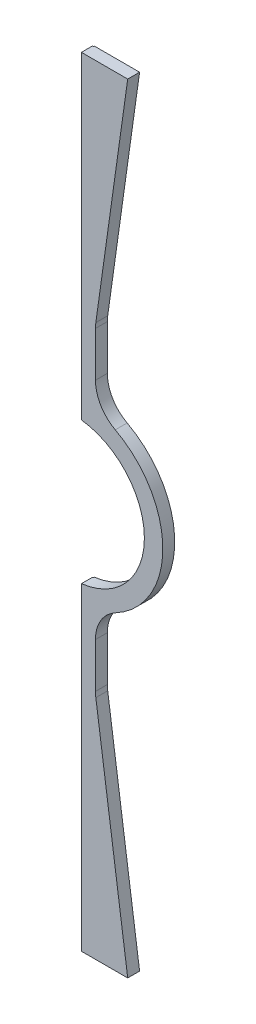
from build123d import *

# Parameters (mm, degrees)
EXTRUDE1_DEPTH = 3.175
SKETCH2_W      = 0.5
SKETCH2_H      = 416
EXTRUDE2_DEPTH = 0.5


with BuildPart() as part:
    # Sketch1 → Extrude1 (new, symmetric)
    with BuildSketch(Plane.XY):
        with BuildLine():
            Line((29.232493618, 208), (4.5, 208))
            Line((4.5, 208), (4.5, 37.873672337))
            ThreePointArc((4.5, 37.873672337), (38.14007153, 0), (4.5, -37.873672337))
            Line((4.5, -37.873672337), (4.5, -208))
            Line((4.5, -208), (29.232493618, -208))
            Line((29.232493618, -208), (12.194638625, -86.769362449))
            ThreePointArc((12.194638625, -86.769362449), (12.048718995, -85.381029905), (12, -83.98590043))
            Line((12, -83.98590043), (12, -60))
            ThreePointArc((12, -60), (14.850141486, -49.710084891), (22.588235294, -42.352941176))
            ThreePointArc((22.588235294, -42.352941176), (48, 0), (22.588235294, 42.352941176))
            ThreePointArc((22.588235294, 42.352941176), (14.850141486, 49.710084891), (12, 60))
            Line((12, 60), (12, 83.98590043))
            ThreePointArc((12, 83.98590043), (12.048718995, 85.381029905), (12.194638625, 86.769362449))
            Line((12.194638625, 86.769362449), (29.232493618, 208))
        make_face()
    extrude(amount=EXTRUDE1_DEPTH, both=True)

    # Sketch2 → Extrude2 (cut)
    with BuildSketch(Plane(origin=(0, 0, -3.175), x_dir=(-1, 0, 0), z_dir=(0, 0, -1))):
        with Locations((-4.75, 0)):
            Rectangle(SKETCH2_W, SKETCH2_H)
    extrude(amount=-EXTRUDE2_DEPTH, mode=Mode.SUBTRACT)


solid = part.part
